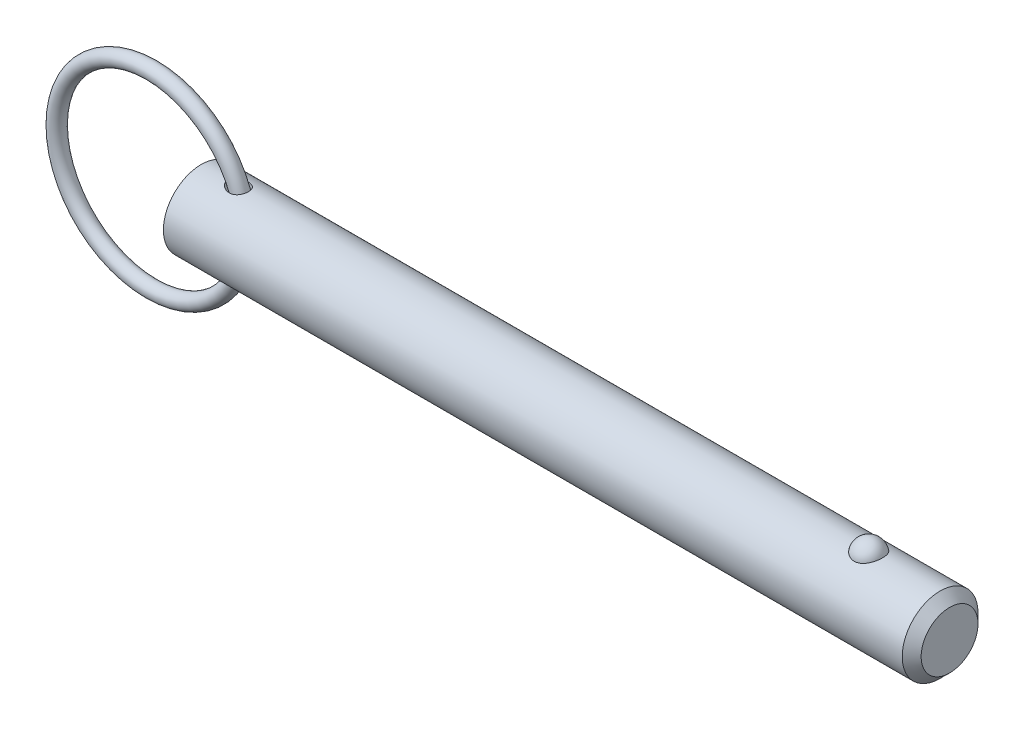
ISO-10303-21;
HEADER;
FILE_DESCRIPTION(('STEP AP214'),'2;1');
FILE_NAME('part.step','',(''),(''),'','','');
FILE_SCHEMA(('AUTOMOTIVE_DESIGN { 1 0 10303 214 1 1 1 1 }'));
ENDSEC;
DATA;
#1=APPLICATION_CONTEXT('core data for automotive mechanical design processes');
#2=APPLICATION_PROTOCOL_DEFINITION('international standard','automotive_design',2000,#1);
#3=PRODUCT_CONTEXT('',#1,'mechanical');
#4=PRODUCT('Part','Part','',(#3));
#5=PRODUCT_RELATED_PRODUCT_CATEGORY('part','',(#4));
#6=PRODUCT_DEFINITION_FORMATION('','',#4);
#7=PRODUCT_DEFINITION_CONTEXT('part definition',#1,'design');
#8=PRODUCT_DEFINITION('design','',#6,#7);
#9=PRODUCT_DEFINITION_SHAPE('','',#8);
#10=(LENGTH_UNIT() NAMED_UNIT(*) SI_UNIT(.MILLI.,.METRE.));
#11=(NAMED_UNIT(*) PLANE_ANGLE_UNIT() SI_UNIT($,.RADIAN.));
#12=(NAMED_UNIT(*) SI_UNIT($,.STERADIAN.) SOLID_ANGLE_UNIT());
#13=UNCERTAINTY_MEASURE_WITH_UNIT(LENGTH_MEASURE(1.E-05),#10,'distance_accuracy_value','');
#14=(GEOMETRIC_REPRESENTATION_CONTEXT(3) GLOBAL_UNCERTAINTY_ASSIGNED_CONTEXT((#13)) GLOBAL_UNIT_ASSIGNED_CONTEXT((#10,
#11,#12)) REPRESENTATION_CONTEXT('',''));
#15=CARTESIAN_POINT('',(0.,0.,0.));
#16=DIRECTION('',(0.,0.,1.));
#17=DIRECTION('',(1.,0.,0.));
#18=AXIS2_PLACEMENT_3D('',#15,#16,#17);
#19=CARTESIAN_POINT('',(-8.34703434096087,0.,0.));
#20=DIRECTION('',(0.,0.,1.));
#21=DIRECTION('',(1.,0.,0.));
#22=AXIS2_PLACEMENT_3D('',#19,#20,#21);
#23=TOROIDAL_SURFACE('',#22,15.875,1.27);
#24=CARTESIAN_POINT('',(8.79796565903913,0.,0.));
#25=VERTEX_POINT('',#24);
#26=VERTEX_LOOP('',#25);
#27=FACE_BOUND('',#26,.T.);
#28=ADVANCED_FACE('P0_F12',(#27),#23,.T.);
#29=CLOSED_SHELL('',(#28));
#30=MANIFOLD_SOLID_BREP('P0_B1',#29);
#31=CARTESIAN_POINT('',(0.,0.,0.));
#32=DIRECTION('',(1.,0.,0.));
#33=DIRECTION('',(0.,0.,-1.));
#34=AXIS2_PLACEMENT_3D('',#31,#32,#33);
#35=CYLINDRICAL_SURFACE('',#34,6.35);
#36=CARTESIAN_POINT('',(4.87230670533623,6.27273159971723,-0.987592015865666));
#37=CARTESIAN_POINT('',(4.94734735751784,6.26035058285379,-1.06623378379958));
#38=CARTESIAN_POINT('',(5.02968768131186,6.24755813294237,-1.13788608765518));
#39=CARTESIAN_POINT('',(5.2053426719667,6.22278258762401,-1.26640223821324));
#40=CARTESIAN_POINT('',(5.29867273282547,6.21080066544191,-1.32324497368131));
#41=CARTESIAN_POINT('',(5.49318962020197,6.18912414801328,-1.42117930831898));
#42=CARTESIAN_POINT('',(5.59435470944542,6.17942350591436,-1.46231273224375));
#43=CARTESIAN_POINT('',(5.80219659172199,6.16352555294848,-1.52793951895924));
#44=CARTESIAN_POINT('',(5.90887152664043,6.15732706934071,-1.55243845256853));
#45=CARTESIAN_POINT('',(6.12818220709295,6.14931784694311,-1.58387975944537));
#46=CARTESIAN_POINT('',(6.24090110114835,6.14763959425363,-1.59029227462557));
#47=CARTESIAN_POINT('',(6.46560233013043,6.14965588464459,-1.58248630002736));
#48=CARTESIAN_POINT('',(6.57758514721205,6.15334646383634,-1.56828303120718));
#49=CARTESIAN_POINT('',(6.78516594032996,6.1652116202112,-1.52091398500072));
#50=CARTESIAN_POINT('',(6.88126802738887,6.17288876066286,-1.48983713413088));
#51=CARTESIAN_POINT('',(7.06576629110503,6.19149190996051,-1.41052329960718));
#52=CARTESIAN_POINT('',(7.15416739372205,6.20241582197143,-1.36229738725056));
#53=CARTESIAN_POINT('',(7.31166929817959,6.2248616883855,-1.25548983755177));
#54=CARTESIAN_POINT('',(7.38181442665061,6.23621734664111,-1.19840625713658));
#55=CARTESIAN_POINT('',(7.51101296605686,6.259037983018,-1.07284763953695));
#56=CARTESIAN_POINT('',(7.57006844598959,6.2705029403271,-1.00437473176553));
#57=CARTESIAN_POINT('',(7.6737469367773,6.29184873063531,-0.860384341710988));
#58=CARTESIAN_POINT('',(7.71876694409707,6.30176816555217,-0.785157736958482));
#59=CARTESIAN_POINT('',(7.79574491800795,6.31935829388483,-0.628053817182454));
#60=CARTESIAN_POINT('',(7.82770308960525,6.32702902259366,-0.546176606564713));
#61=CARTESIAN_POINT('',(7.87788845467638,6.33930929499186,-0.377876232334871));
#62=CARTESIAN_POINT('',(7.89608106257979,6.34391112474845,-0.291442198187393));
#63=CARTESIAN_POINT('',(7.91820729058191,6.34953044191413,-0.116652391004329));
#64=CARTESIAN_POINT('',(7.9221404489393,6.35054781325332,-0.0282965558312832));
#65=CARTESIAN_POINT('',(7.91564686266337,6.34888556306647,0.148263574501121));
#66=CARTESIAN_POINT('',(7.90515337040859,6.34618875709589,0.236465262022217));
#67=CARTESIAN_POINT('',(7.8699153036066,6.33735741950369,0.409798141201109));
#68=CARTESIAN_POINT('',(7.84517062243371,6.33122286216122,0.494929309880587));
#69=CARTESIAN_POINT('',(7.7819985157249,6.31618517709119,0.659657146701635));
#70=CARTESIAN_POINT('',(7.74357645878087,6.30728313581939,0.739255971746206));
#71=CARTESIAN_POINT('',(7.65396632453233,6.28769050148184,0.890663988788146));
#72=CARTESIAN_POINT('',(7.60277911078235,6.27700002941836,0.962473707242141));
#73=CARTESIAN_POINT('',(7.48925881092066,6.2550822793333,1.09590260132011));
#74=CARTESIAN_POINT('',(7.42698604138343,6.24385813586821,1.15757361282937));
#75=CARTESIAN_POINT('',(7.29283556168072,6.2220655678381,1.26951234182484));
#76=CARTESIAN_POINT('',(7.2209588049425,6.21149707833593,1.31978118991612));
#77=CARTESIAN_POINT('',(7.06971853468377,6.19216002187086,1.40772509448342));
#78=CARTESIAN_POINT('',(6.99035873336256,6.18339056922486,1.44540635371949));
#79=CARTESIAN_POINT('',(6.82642723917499,6.16851603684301,1.50762653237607));
#80=CARTESIAN_POINT('',(6.7418548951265,6.16241129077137,1.53216380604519));
#81=CARTESIAN_POINT('',(6.56686412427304,6.15321474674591,1.56869994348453));
#82=CARTESIAN_POINT('',(6.47634467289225,6.15023369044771,1.58023897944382));
#83=CARTESIAN_POINT('',(6.29456956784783,6.14778331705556,1.58974172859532));
#84=CARTESIAN_POINT('',(6.20331368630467,6.1483151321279,1.58770106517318));
#85=CARTESIAN_POINT('',(6.01385969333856,6.15284811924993,1.5700487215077));
#86=CARTESIAN_POINT('',(5.91578322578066,6.15715979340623,1.55322212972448));
#87=CARTESIAN_POINT('',(5.72331909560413,6.16902415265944,1.5054032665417));
#88=CARTESIAN_POINT('',(5.6289344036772,6.17657939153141,1.4743998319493));
#89=CARTESIAN_POINT('',(5.4357260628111,6.19502494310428,1.39499475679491));
#90=CARTESIAN_POINT('',(5.33755891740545,6.20619097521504,1.34505268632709));
#91=CARTESIAN_POINT('',(5.15090047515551,6.23006191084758,1.22975103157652));
#92=CARTESIAN_POINT('',(5.06240741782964,6.24276653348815,1.16439425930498));
#93=CARTESIAN_POINT('',(4.91171642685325,6.26607433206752,1.03083814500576));
#94=CARTESIAN_POINT('',(4.84758224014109,6.27668356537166,0.964825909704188));
#95=CARTESIAN_POINT('',(4.73090054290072,6.29683133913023,0.823112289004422));
#96=CARTESIAN_POINT('',(4.67833688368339,6.30637136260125,0.747424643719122));
#97=CARTESIAN_POINT('',(4.59543145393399,6.32183254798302,0.601150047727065));
#98=CARTESIAN_POINT('',(4.56283099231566,6.32809321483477,0.531883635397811));
#99=CARTESIAN_POINT('',(4.50941370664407,6.33849198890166,0.388778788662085));
#100=CARTESIAN_POINT('',(4.48858876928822,6.34263155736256,0.314943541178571));
#101=CARTESIAN_POINT('',(4.46008864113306,6.3483236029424,0.164282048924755));
#102=CARTESIAN_POINT('',(4.45247558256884,6.34986385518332,0.08744340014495));
#103=CARTESIAN_POINT('',(4.45121096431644,6.35011863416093,-0.0663538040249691));
#104=CARTESIAN_POINT('',(4.45755802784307,6.34883343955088,-0.143312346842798));
#105=CARTESIAN_POINT('',(4.48267656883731,6.34380948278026,-0.288945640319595));
#106=CARTESIAN_POINT('',(4.50045680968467,6.34026665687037,-0.357802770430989));
#107=CARTESIAN_POINT('',(4.54636050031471,6.33128211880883,-0.491815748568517));
#108=CARTESIAN_POINT('',(4.57448566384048,6.32584009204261,-0.556970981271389));
#109=CARTESIAN_POINT('',(4.64209700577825,6.31308107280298,-0.687092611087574));
#110=CARTESIAN_POINT('',(4.68226903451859,6.30565525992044,-0.751689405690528));
#111=CARTESIAN_POINT('',(4.77120834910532,6.28979741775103,-0.874524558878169));
#112=CARTESIAN_POINT('',(4.81998302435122,6.28136452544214,-0.932757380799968));
#113=CARTESIAN_POINT('',(4.87230670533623,6.27273159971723,-0.987592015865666));
#114=B_SPLINE_CURVE_WITH_KNOTS('',3,(#36,#37,#38,#39,#40,#41,#42,#43,#44,#45,#46,#47,#48,#49,
#50,#51,#52,#53,#54,#55,#56,#57,#58,#59,#60,#61,#62,#63,#64,#65,#66,#67,#68,#69,#70,#71,#72,#73,
#74,#75,#76,#77,#78,#79,#80,#81,#82,#83,#84,#85,#86,#87,#88,#89,#90,#91,#92,#93,#94,#95,#96,#97,
#98,#99,#100,#101,#102,#103,#104,#105,#106,#107,#108,#109,#110,#111,#112,#113),.UNSPECIFIED.,
.T.,.F.,(4,2,2,2,2,2,2,2,2,2,2,2,2,2,2,2,2,2,2,2,2,2,2,2,2,2,2,2,2,2,2,2,2,2,2,2,2,2,4),(0.,
0.327902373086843,0.65626964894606,0.983756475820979,1.31113357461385,1.64800657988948,
1.98463099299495,2.28681225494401,2.58879878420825,2.86088594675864,3.13292229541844,
3.3963648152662,3.65980320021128,3.92390128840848,4.18800792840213,4.45334062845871,
4.7186753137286,4.98390596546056,5.24911867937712,5.51293017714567,5.7767155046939,
6.04037065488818,6.30405880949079,6.57680801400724,6.84964512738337,7.14724526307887,
7.44508014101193,7.77572668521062,8.10631295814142,8.38318772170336,8.65967357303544,
8.88915303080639,9.11847418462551,9.34887088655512,9.57924486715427,9.79193291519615,
10.0046562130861,10.2330958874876,10.4617327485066),.UNSPECIFIED.);
#115=CARTESIAN_POINT('',(4.87230670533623,6.27273159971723,-0.987592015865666));
#116=VERTEX_POINT('',#115);
#117=EDGE_CURVE('P1_E40',#116,#116,#114,.T.);
#118=ORIENTED_EDGE('',*,*,#117,.T.);
#119=EDGE_LOOP('',(#118));
#120=FACE_BOUND('',#119,.T.);
#121=CARTESIAN_POINT('',(123.8125,0.,0.));
#122=DIRECTION('',(1.,0.,0.));
#123=DIRECTION('',(0.,0.,-1.));
#124=AXIS2_PLACEMENT_3D('',#121,#122,#123);
#125=CIRCLE('',#124,6.35);
#126=CARTESIAN_POINT('',(123.8125,0.,-6.35));
#127=VERTEX_POINT('',#126);
#128=EDGE_CURVE('P1_E25',#127,#127,#125,.T.);
#129=ORIENTED_EDGE('',*,*,#128,.F.);
#130=EDGE_LOOP('',(#129));
#131=FACE_BOUND('',#130,.T.);
#132=CARTESIAN_POINT('',(0.,0.,0.));
#133=DIRECTION('',(1.,0.,0.));
#134=DIRECTION('',(0.,0.,-1.));
#135=AXIS2_PLACEMENT_3D('',#132,#133,#134);
#136=CIRCLE('',#135,6.35);
#137=CARTESIAN_POINT('',(0.,0.,-6.35));
#138=VERTEX_POINT('',#137);
#139=EDGE_CURVE('P1_E9',#138,#138,#136,.T.);
#140=ORIENTED_EDGE('',*,*,#139,.T.);
#141=EDGE_LOOP('',(#140));
#142=FACE_BOUND('',#141,.T.);
#143=CARTESIAN_POINT('',(111.850021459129,5.87502187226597,2.40969251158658));
#144=CARTESIAN_POINT('',(111.725030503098,5.87501645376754,2.40969773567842));
#145=CARTESIAN_POINT('',(111.600080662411,5.87916061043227,2.39967292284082));
#146=CARTESIAN_POINT('',(111.353909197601,5.89523112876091,2.35991730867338));
#147=CARTESIAN_POINT('',(111.232686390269,5.90715499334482,2.3301928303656));
#148=CARTESIAN_POINT('',(110.997517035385,5.93739567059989,2.25201402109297));
#149=CARTESIAN_POINT('',(110.883560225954,5.95570321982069,2.20358681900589));
#150=CARTESIAN_POINT('',(110.66557352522,5.99672067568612,2.08937987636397));
#151=CARTESIAN_POINT('',(110.561545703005,6.01943149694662,2.02359652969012));
#152=CARTESIAN_POINT('',(110.362943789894,6.06760647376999,1.87428969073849));
#153=CARTESIAN_POINT('',(110.268726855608,6.09313095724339,1.79031110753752));
#154=CARTESIAN_POINT('',(110.095255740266,6.14375873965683,1.60800178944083));
#155=CARTESIAN_POINT('',(110.016004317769,6.16886196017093,1.50966841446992));
#156=CARTESIAN_POINT('',(109.870845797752,6.2172460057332,1.29645884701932));
#157=CARTESIAN_POINT('',(109.805688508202,6.24039621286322,1.18104158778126));
#158=CARTESIAN_POINT('',(109.694703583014,6.28117277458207,0.940351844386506));
#159=CARTESIAN_POINT('',(109.648877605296,6.29879865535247,0.815078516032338));
#160=CARTESIAN_POINT('',(109.577023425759,6.32692073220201,0.556494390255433));
#161=CARTESIAN_POINT('',(109.551249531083,6.33732517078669,0.423102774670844));
#162=CARTESIAN_POINT('',(109.520988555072,6.34957673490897,0.153542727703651));
#163=CARTESIAN_POINT('',(109.516500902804,6.35142408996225,0.0173743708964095));
#164=CARTESIAN_POINT('',(109.528865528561,6.34638925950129,-0.253036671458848));
#165=CARTESIAN_POINT('',(109.545594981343,6.33955731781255,-0.387285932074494));
#166=CARTESIAN_POINT('',(109.599843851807,6.31794129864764,-0.650851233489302));
#167=CARTESIAN_POINT('',(109.637363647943,6.3031570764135,-0.780167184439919));
#168=CARTESIAN_POINT('',(109.732500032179,6.26711642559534,-1.03041949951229));
#169=CARTESIAN_POINT('',(109.790143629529,6.24585130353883,-1.15134433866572));
#170=CARTESIAN_POINT('',(109.924352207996,6.19905619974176,-1.38129800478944));
#171=CARTESIAN_POINT('',(110.000918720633,6.17352587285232,-1.49032586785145));
#172=CARTESIAN_POINT('',(110.171753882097,6.12080227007,-1.69393164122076));
#173=CARTESIAN_POINT('',(110.266100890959,6.09360200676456,-1.78844209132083));
#174=CARTESIAN_POINT('',(110.470119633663,6.04070434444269,-1.95970536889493));
#175=CARTESIAN_POINT('',(110.579790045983,6.01500681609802,-2.03645972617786));
#176=CARTESIAN_POINT('',(110.809187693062,5.96867714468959,-2.1684564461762));
#177=CARTESIAN_POINT('',(110.928652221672,5.94794910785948,-2.22412062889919));
#178=CARTESIAN_POINT('',(111.176218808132,5.91340580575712,-2.31440992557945));
#179=CARTESIAN_POINT('',(111.304317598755,5.8995879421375,-2.34904294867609));
#180=CARTESIAN_POINT('',(111.558582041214,5.88111049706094,-2.39491590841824));
#181=CARTESIAN_POINT('',(111.684520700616,5.876025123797,-2.40724512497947));
#182=CARTESIAN_POINT('',(111.936786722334,5.87428980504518,-2.41147867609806));
#183=CARTESIAN_POINT('',(112.063114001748,5.87763817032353,-2.40338710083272));
#184=CARTESIAN_POINT('',(112.308417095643,5.89212921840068,-2.36762715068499));
#185=CARTESIAN_POINT('',(112.427499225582,5.90302431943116,-2.34058030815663));
#186=CARTESIAN_POINT('',(112.65924472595,5.93113752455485,-2.26839066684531));
#187=CARTESIAN_POINT('',(112.771907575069,5.94835614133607,-2.22324640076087));
#188=CARTESIAN_POINT('',(112.990400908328,5.98773016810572,-2.11493806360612));
#189=CARTESIAN_POINT('',(113.096028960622,6.00998499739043,-2.05140269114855));
#190=CARTESIAN_POINT('',(113.295300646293,6.05690144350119,-1.90842705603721));
#191=CARTESIAN_POINT('',(113.388941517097,6.08156361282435,-1.82898313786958));
#192=CARTESIAN_POINT('',(113.566675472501,6.13211715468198,-1.65182429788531));
#193=CARTESIAN_POINT('',(113.650055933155,6.15800825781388,-1.55339381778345));
#194=CARTESIAN_POINT('',(113.799790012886,6.20712834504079,-1.34374214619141));
#195=CARTESIAN_POINT('',(113.866140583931,6.23035685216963,-1.23251867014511));
#196=CARTESIAN_POINT('',(113.982345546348,6.27251177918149,-0.996447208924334));
#197=CARTESIAN_POINT('',(114.031607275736,6.29127762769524,-0.871278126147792));
#198=CARTESIAN_POINT('',(114.109614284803,6.3215862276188,-0.613870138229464));
#199=CARTESIAN_POINT('',(114.138359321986,6.33312889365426,-0.481631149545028));
#200=CARTESIAN_POINT('',(114.17477058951,6.34782349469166,-0.213672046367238));
#201=CARTESIAN_POINT('',(114.182413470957,6.35096613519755,-0.0779482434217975));
#202=CARTESIAN_POINT('',(114.176395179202,6.34851322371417,0.192943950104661));
#203=CARTESIAN_POINT('',(114.162734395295,6.3429178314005,0.328112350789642));
#204=CARTESIAN_POINT('',(114.11450361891,6.32360512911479,0.593406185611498));
#205=CARTESIAN_POINT('',(114.080031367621,6.30992579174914,0.723552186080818));
#206=CARTESIAN_POINT('',(113.990953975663,6.27586325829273,0.975834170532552));
#207=CARTESIAN_POINT('',(113.93634761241,6.25547965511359,1.09796966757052));
#208=CARTESIAN_POINT('',(113.80775879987,6.20998183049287,1.33148921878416));
#209=CARTESIAN_POINT('',(113.733674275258,6.18484288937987,1.44281227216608));
#210=CARTESIAN_POINT('',(113.567820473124,6.13258735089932,1.65087683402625));
#211=CARTESIAN_POINT('',(113.476051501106,6.10547078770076,1.74761859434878));
#212=CARTESIAN_POINT('',(113.277183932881,6.0523587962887,1.92350926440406));
#213=CARTESIAN_POINT('',(113.170133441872,6.0263601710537,2.00271146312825));
#214=CARTESIAN_POINT('',(112.943138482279,5.97843747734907,2.14154159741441));
#215=CARTESIAN_POINT('',(112.823191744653,5.95651412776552,2.20116608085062));
#216=CARTESIAN_POINT('',(112.564523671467,5.91812106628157,2.30250570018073));
#217=CARTESIAN_POINT('',(112.42506980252,5.90217533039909,2.34256795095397));
#218=CARTESIAN_POINT('',(112.140397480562,5.88063128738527,2.39615214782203));
#219=CARTESIAN_POINT('',(111.99518174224,5.87502816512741,2.4096864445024));
#220=CARTESIAN_POINT('',(111.850021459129,5.87502187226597,2.40969251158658));
#221=B_SPLINE_CURVE_WITH_KNOTS('',3,(#143,#144,#145,#146,#147,#148,#149,#150,#151,#152,#153,
#154,#155,#156,#157,#158,#159,#160,#161,#162,#163,#164,#165,#166,#167,#168,#169,#170,#171,#172,
#173,#174,#175,#176,#177,#178,#179,#180,#181,#182,#183,#184,#185,#186,#187,#188,#189,#190,#191,
#192,#193,#194,#195,#196,#197,#198,#199,#200,#201,#202,#203,#204,#205,#206,#207,#208,#209,#210,
#211,#212,#213,#214,#215,#216,#217,#218,#219,#220),.UNSPECIFIED.,.T.,.F.,(4,2,2,2,2,2,2,2,2,2,2,
2,2,2,2,2,2,2,2,2,2,2,2,2,2,2,2,2,2,2,2,2,2,2,2,2,2,2,4),(0.,0.374440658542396,
0.748761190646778,1.12254078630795,1.49639810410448,1.88098871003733,2.26565013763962,
2.66741104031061,3.06920639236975,3.47601794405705,3.88281858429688,4.28727498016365,
4.69173873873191,5.09674745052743,5.50178895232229,5.9086591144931,6.31549420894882,
6.71369855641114,7.11175305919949,7.48978077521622,7.86773278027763,8.23383886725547,
8.59997464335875,8.97409044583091,9.34829231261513,9.74122667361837,10.1342313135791,
10.5397522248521,10.9452779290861,11.3512521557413,11.7572189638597,12.1612938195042,
12.5653932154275,12.9716540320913,13.3779078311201,13.7829098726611,14.1879832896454,
14.6230486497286,15.0579114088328),.UNSPECIFIED.);
#222=CARTESIAN_POINT('',(111.850021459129,5.87502187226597,2.40969251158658));
#223=VERTEX_POINT('',#222);
#224=EDGE_CURVE('P1_E34',#223,#223,#221,.T.);
#225=ORIENTED_EDGE('',*,*,#224,.T.);
#226=EDGE_LOOP('',(#225));
#227=FACE_BOUND('',#226,.T.);
#228=CARTESIAN_POINT('',(4.87230670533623,-6.27273159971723,-0.987592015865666));
#229=CARTESIAN_POINT('',(4.81440819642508,-6.28228431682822,-0.926913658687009));
#230=CARTESIAN_POINT('',(4.76085022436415,-6.29159289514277,-0.862071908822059));
#231=CARTESIAN_POINT('',(4.66448472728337,-6.3088950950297,-0.72465504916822));
#232=CARTESIAN_POINT('',(4.62166818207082,-6.31688981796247,-0.652086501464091));
#233=CARTESIAN_POINT('',(4.54882773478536,-6.33076917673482,-0.49974775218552));
#234=CARTESIAN_POINT('',(4.51891553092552,-6.33663532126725,-0.419921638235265));
#235=CARTESIAN_POINT('',(4.47476924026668,-6.3453711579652,-0.255882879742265));
#236=CARTESIAN_POINT('',(4.46051880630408,-6.34824397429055,-0.171674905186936));
#237=CARTESIAN_POINT('',(4.44966179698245,-6.35043041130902,-0.0120763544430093));
#238=CARTESIAN_POINT('',(4.45117530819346,-6.35012328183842,0.0631849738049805));
#239=CARTESIAN_POINT('',(4.46726452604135,-6.34689000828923,0.212230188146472));
#240=CARTESIAN_POINT('',(4.48184026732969,-6.3439638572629,0.286014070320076));
#241=CARTESIAN_POINT('',(4.52202068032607,-6.33603071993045,0.426550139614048));
#242=CARTESIAN_POINT('',(4.54707079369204,-6.33112875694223,0.493469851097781));
#243=CARTESIAN_POINT('',(4.6066985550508,-6.31972370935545,0.622743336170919));
#244=CARTESIAN_POINT('',(4.64127887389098,-6.31322017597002,0.685095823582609));
#245=CARTESIAN_POINT('',(4.72328142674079,-6.29826068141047,0.811769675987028));
#246=CARTESIAN_POINT('',(4.77176118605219,-6.28966287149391,0.875386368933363));
#247=CARTESIAN_POINT('',(4.87703902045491,-6.27182325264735,0.99519278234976));
#248=CARTESIAN_POINT('',(4.93384225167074,-6.26258104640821,1.05137785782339));
#249=CARTESIAN_POINT('',(5.06617436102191,-6.24228878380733,1.16635591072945));
#250=CARTESIAN_POINT('',(5.14318167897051,-6.23124423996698,1.22345054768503));
#251=CARTESIAN_POINT('',(5.30475767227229,-6.21023402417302,1.32598441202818));
#252=CARTESIAN_POINT('',(5.38933237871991,-6.20026922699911,1.37141422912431));
#253=CARTESIAN_POINT('',(5.5776013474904,-6.18099350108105,1.45601817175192));
#254=CARTESIAN_POINT('',(5.68224348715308,-6.17201456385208,1.4931788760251));
#255=CARTESIAN_POINT('',(5.89649087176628,-6.15800474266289,1.5499484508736));
#256=CARTESIAN_POINT('',(6.0060970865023,-6.15297463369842,1.56955387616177));
#257=CARTESIAN_POINT('',(6.22752772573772,-6.14779725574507,1.58971993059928));
#258=CARTESIAN_POINT('',(6.33935715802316,-6.14766266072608,1.59023112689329));
#259=CARTESIAN_POINT('',(6.56108231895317,-6.15269227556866,1.57066564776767));
#260=CARTESIAN_POINT('',(6.67097982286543,-6.15785133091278,1.55060899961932));
#261=CARTESIAN_POINT('',(6.87257705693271,-6.17211580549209,1.4927326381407));
#262=CARTESIAN_POINT('',(6.96494608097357,-6.18072242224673,1.45711948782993));
#263=CARTESIAN_POINT('',(7.14129343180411,-6.20069920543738,1.36960980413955));
#264=CARTESIAN_POINT('',(7.22527609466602,-6.21206793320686,1.31772174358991));
#265=CARTESIAN_POINT('',(7.37471505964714,-6.23497047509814,1.20443359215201));
#266=CARTESIAN_POINT('',(7.44115811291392,-6.24639757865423,1.14430788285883));
#267=CARTESIAN_POINT('',(7.56261868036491,-6.26896339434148,1.0134084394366));
#268=CARTESIAN_POINT('',(7.61763801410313,-6.28010215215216,0.942636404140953));
#269=CARTESIAN_POINT('',(7.71360563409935,-6.30055923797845,0.794304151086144));
#270=CARTESIAN_POINT('',(7.75485562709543,-6.3099143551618,0.716943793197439));
#271=CARTESIAN_POINT('',(7.82406051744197,-6.32610528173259,0.556244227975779));
#272=CARTESIAN_POINT('',(7.85201540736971,-6.33294108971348,0.472905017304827));
#273=CARTESIAN_POINT('',(7.89408663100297,-6.34338077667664,0.302249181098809));
#274=CARTESIAN_POINT('',(7.90814615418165,-6.34697138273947,0.214917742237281));
#275=CARTESIAN_POINT('',(7.92192329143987,-6.35048887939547,0.0390564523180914));
#276=CARTESIAN_POINT('',(7.92164046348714,-6.3504156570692,-0.0494734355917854));
#277=CARTESIAN_POINT('',(7.90670754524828,-6.34660520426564,-0.225592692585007));
#278=CARTESIAN_POINT('',(7.89199989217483,-6.34285329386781,-0.31317687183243));
#279=CARTESIAN_POINT('',(7.8484534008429,-6.33206809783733,-0.484549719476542));
#280=CARTESIAN_POINT('',(7.81961455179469,-6.32503480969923,-0.568338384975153));
#281=CARTESIAN_POINT('',(7.74850591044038,-6.30846389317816,-0.729625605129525));
#282=CARTESIAN_POINT('',(7.70625193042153,-6.29892921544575,-0.807131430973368));
#283=CARTESIAN_POINT('',(7.60933437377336,-6.27840608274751,-0.953731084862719));
#284=CARTESIAN_POINT('',(7.55467181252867,-6.2674177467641,-1.02282560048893));
#285=CARTESIAN_POINT('',(7.43471786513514,-6.24527869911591,-1.15028913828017));
#286=CARTESIAN_POINT('',(7.36948829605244,-6.23412925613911,-1.20871657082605));
#287=CARTESIAN_POINT('',(7.2300172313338,-6.21283678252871,-1.3137894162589));
#288=CARTESIAN_POINT('',(7.15577649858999,-6.20269366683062,-1.36043582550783));
#289=CARTESIAN_POINT('',(7.00025986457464,-6.18446636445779,-1.4410399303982));
#290=CARTESIAN_POINT('',(6.91896776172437,-6.17638709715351,-1.47496739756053));
#291=CARTESIAN_POINT('',(6.75184232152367,-6.16309237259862,-1.52957024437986));
#292=CARTESIAN_POINT('',(6.66600814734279,-6.15787744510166,-1.55024317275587));
#293=CARTESIAN_POINT('',(6.48842585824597,-6.15055064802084,-1.57906962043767));
#294=CARTESIAN_POINT('',(6.39658108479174,-6.14857915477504,-1.58665744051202));
#295=CARTESIAN_POINT('',(6.21279832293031,-6.14817707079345,-1.58821048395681));
#296=CARTESIAN_POINT('',(6.12086031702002,-6.14974736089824,-1.58217231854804));
#297=CARTESIAN_POINT('',(5.92996902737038,-6.15640095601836,-1.55609403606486));
#298=CARTESIAN_POINT('',(5.83120653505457,-6.16181208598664,-1.53474519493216));
#299=CARTESIAN_POINT('',(5.63804881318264,-6.17573474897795,-1.47771859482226));
#300=CARTESIAN_POINT('',(5.54365953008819,-6.18425037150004,-1.44202192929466));
#301=CARTESIAN_POINT('',(5.34413923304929,-6.20522938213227,-1.34918979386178));
#302=CARTESIAN_POINT('',(5.24033140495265,-6.21813417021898,-1.28928337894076));
#303=CARTESIAN_POINT('',(5.04554233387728,-6.24510162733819,-1.15156760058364));
#304=CARTESIAN_POINT('',(4.9545459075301,-6.25916289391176,-1.07377972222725));
#305=CARTESIAN_POINT('',(4.87230670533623,-6.27273159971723,-0.987592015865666));
#306=B_SPLINE_CURVE_WITH_KNOTS('',3,(#228,#229,#230,#231,#232,#233,#234,#235,#236,#237,#238,
#239,#240,#241,#242,#243,#244,#245,#246,#247,#248,#249,#250,#251,#252,#253,#254,#255,#256,#257,
#258,#259,#260,#261,#262,#263,#264,#265,#266,#267,#268,#269,#270,#271,#272,#273,#274,#275,#276,
#277,#278,#279,#280,#281,#282,#283,#284,#285,#286,#287,#288,#289,#290,#291,#292,#293,#294,#295,
#296,#297,#298,#299,#300,#301,#302,#303,#304,#305),.UNSPECIFIED.,.T.,.F.,(4,2,2,2,2,2,2,2,2,2,2,
2,2,2,2,2,2,2,2,2,2,2,2,2,2,2,2,2,2,2,2,2,2,2,2,2,2,2,4),(0.,0.252951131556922,
0.505689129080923,0.760572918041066,1.01519041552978,1.23982791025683,1.46446600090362,
1.67847364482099,1.89254132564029,2.13299551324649,2.37359928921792,2.6619896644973,
2.95061196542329,3.28329078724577,3.61603488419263,3.9496403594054,4.28292130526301,
4.57939201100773,4.87570862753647,5.14538810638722,5.41502459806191,5.67829123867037,
5.94155802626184,6.20589676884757,6.47024365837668,6.73564974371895,7.00105603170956,
7.26615064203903,7.53122356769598,7.79479837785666,8.05835088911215,8.32252586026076,
8.58674967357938,8.86213419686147,9.137587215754,9.43991696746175,9.74264642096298,
10.1023688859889,10.461661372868),.UNSPECIFIED.);
#307=CARTESIAN_POINT('',(4.87230670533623,-6.27273159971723,-0.987592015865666));
#308=VERTEX_POINT('',#307);
#309=EDGE_CURVE('P1_E17',#308,#308,#306,.T.);
#310=ORIENTED_EDGE('',*,*,#309,.T.);
#311=EDGE_LOOP('',(#310));
#312=FACE_BOUND('',#311,.T.);
#313=ADVANCED_FACE('P1_F13',(#120,#131,#142,#227,#312),#35,.T.);
#314=CARTESIAN_POINT('',(0.,0.,0.));
#315=DIRECTION('',(-1.,0.,0.));
#316=DIRECTION('',(0.,0.,1.));
#317=AXIS2_PLACEMENT_3D('',#314,#315,#316);
#318=PLANE('',#317);
#319=ORIENTED_EDGE('',*,*,#139,.F.);
#320=EDGE_LOOP('',(#319));
#321=FACE_BOUND('',#320,.T.);
#322=ADVANCED_FACE('P1_F15',(#321),#318,.T.);
#323=CARTESIAN_POINT('',(125.4,0.,0.));
#324=DIRECTION('',(-1.,0.,0.));
#325=DIRECTION('',(0.,0.,1.));
#326=AXIS2_PLACEMENT_3D('',#323,#324,#325);
#327=CONICAL_SURFACE('',#326,4.76250000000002,0.785398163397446);
#328=ORIENTED_EDGE('',*,*,#128,.T.);
#329=EDGE_LOOP('',(#328));
#330=FACE_BOUND('',#329,.T.);
#331=CARTESIAN_POINT('',(125.4,0.,0.));
#332=DIRECTION('',(1.,0.,0.));
#333=DIRECTION('',(0.,0.,-1.));
#334=AXIS2_PLACEMENT_3D('',#331,#332,#333);
#335=CIRCLE('',#334,4.76250000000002);
#336=CARTESIAN_POINT('',(125.4,0.,-4.76250000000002));
#337=VERTEX_POINT('',#336);
#338=EDGE_CURVE('P1_E30',#337,#337,#335,.T.);
#339=ORIENTED_EDGE('',*,*,#338,.F.);
#340=EDGE_LOOP('',(#339));
#341=FACE_BOUND('',#340,.T.);
#342=ADVANCED_FACE('P1_F55',(#330,#341),#327,.T.);
#343=CARTESIAN_POINT('',(125.4,4.76250000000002,0.));
#344=DIRECTION('',(1.,0.,0.));
#345=DIRECTION('',(0.,0.,-1.));
#346=AXIS2_PLACEMENT_3D('',#343,#344,#345);
#347=PLANE('',#346);
#348=ORIENTED_EDGE('',*,*,#338,.T.);
#349=EDGE_LOOP('',(#348));
#350=FACE_BOUND('',#349,.T.);
#351=ADVANCED_FACE('P1_F51',(#350),#347,.T.);
#352=CARTESIAN_POINT('',(111.850021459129,5.715,0.));
#353=DIRECTION('',(-1.,0.,0.));
#354=DIRECTION('',(0.,1.,0.));
#355=AXIS2_PLACEMENT_3D('',#352,#353,#354);
#356=SPHERICAL_SURFACE('',#355,2.41499999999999);
#357=ORIENTED_EDGE('',*,*,#224,.F.);
#358=EDGE_LOOP('',(#357));
#359=FACE_BOUND('',#358,.T.);
#360=ADVANCED_FACE('P1_F46',(#359),#356,.T.);
#361=CARTESIAN_POINT('',(-8.34703434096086,0.,0.));
#362=DIRECTION('',(0.,0.,1.));
#363=DIRECTION('',(1.,0.,0.));
#364=AXIS2_PLACEMENT_3D('',#361,#362,#363);
#365=TOROIDAL_SURFACE('',#364,15.875,1.5875);
#366=ORIENTED_EDGE('',*,*,#309,.F.);
#367=EDGE_LOOP('',(#366));
#368=FACE_BOUND('',#367,.T.);
#369=ORIENTED_EDGE('',*,*,#117,.F.);
#370=EDGE_LOOP('',(#369));
#371=FACE_BOUND('',#370,.T.);
#372=ADVANCED_FACE('P1_F50',(#368,#371),#365,.F.);
#373=CLOSED_SHELL('',(#313,#322,#342,#351,#360,#372));
#374=MANIFOLD_SOLID_BREP('P1_B1',#373);
#375=ADVANCED_BREP_SHAPE_REPRESENTATION('',(#18,#30,#374),#14);
#376=SHAPE_DEFINITION_REPRESENTATION(#9,#375);
ENDSEC;
END-ISO-10303-21;
